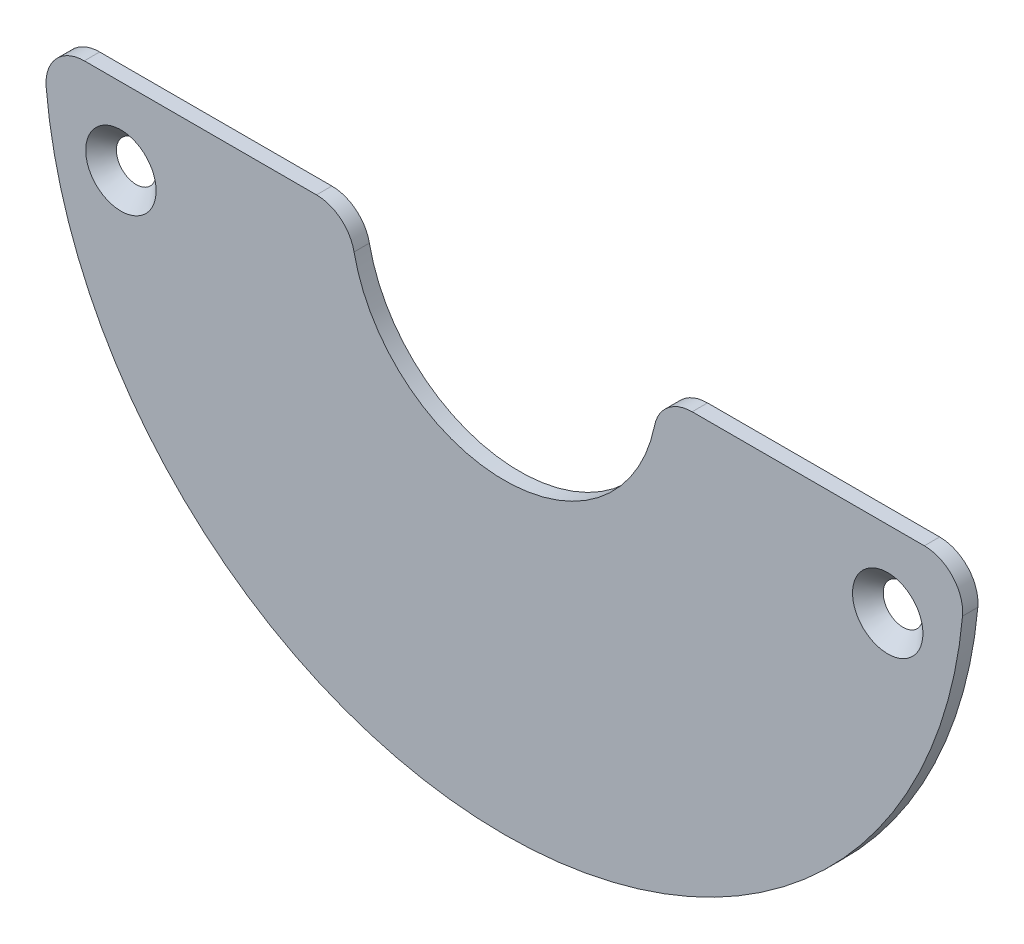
ISO-10303-21;
HEADER;
FILE_DESCRIPTION(('STEP AP214'),'2;1');
FILE_NAME('part.step','',(''),(''),'','','');
FILE_SCHEMA(('AUTOMOTIVE_DESIGN { 1 0 10303 214 1 1 1 1 }'));
ENDSEC;
DATA;
#1=APPLICATION_CONTEXT('core data for automotive mechanical design processes');
#2=APPLICATION_PROTOCOL_DEFINITION('international standard','automotive_design',2000,#1);
#3=PRODUCT_CONTEXT('',#1,'mechanical');
#4=PRODUCT('Part','Part','',(#3));
#5=PRODUCT_RELATED_PRODUCT_CATEGORY('part','',(#4));
#6=PRODUCT_DEFINITION_FORMATION('','',#4);
#7=PRODUCT_DEFINITION_CONTEXT('part definition',#1,'design');
#8=PRODUCT_DEFINITION('design','',#6,#7);
#9=PRODUCT_DEFINITION_SHAPE('','',#8);
#10=(LENGTH_UNIT() NAMED_UNIT(*) SI_UNIT(.MILLI.,.METRE.));
#11=(NAMED_UNIT(*) PLANE_ANGLE_UNIT() SI_UNIT($,.RADIAN.));
#12=(NAMED_UNIT(*) SI_UNIT($,.STERADIAN.) SOLID_ANGLE_UNIT());
#13=UNCERTAINTY_MEASURE_WITH_UNIT(LENGTH_MEASURE(1.E-05),#10,'distance_accuracy_value','');
#14=(GEOMETRIC_REPRESENTATION_CONTEXT(3) GLOBAL_UNCERTAINTY_ASSIGNED_CONTEXT((#13)) GLOBAL_UNIT_ASSIGNED_CONTEXT((#10,
#11,#12)) REPRESENTATION_CONTEXT('',''));
#15=CARTESIAN_POINT('',(0.,0.,0.));
#16=DIRECTION('',(0.,0.,1.));
#17=DIRECTION('',(1.,0.,0.));
#18=AXIS2_PLACEMENT_3D('',#15,#16,#17);
#19=CARTESIAN_POINT('',(24.4948974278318,-5.,0.));
#20=DIRECTION('',(0.,0.,1.));
#21=DIRECTION('',(1.,0.,0.));
#22=AXIS2_PLACEMENT_3D('',#19,#20,#21);
#23=PLANE('',#22);
#24=CARTESIAN_POINT('',(-50.,-10.,0.));
#25=DIRECTION('',(0.,0.,1.));
#26=DIRECTION('',(1.,0.,0.));
#27=AXIS2_PLACEMENT_3D('',#24,#25,#26);
#28=CIRCLE('',#27,2.59);
#29=CARTESIAN_POINT('',(-47.41,-10.,0.));
#30=VERTEX_POINT('',#29);
#31=EDGE_CURVE('E35',#30,#30,#28,.T.);
#32=ORIENTED_EDGE('',*,*,#31,.T.);
#33=EDGE_LOOP('',(#32));
#34=FACE_BOUND('',#33,.T.);
#35=CARTESIAN_POINT('',(24.4948974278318,-5.,0.));
#36=DIRECTION('',(0.,0.,1.));
#37=DIRECTION('',(1.,0.,0.));
#38=AXIS2_PLACEMENT_3D('',#35,#36,#37);
#39=CIRCLE('',#38,5.);
#40=CARTESIAN_POINT('',(24.4948974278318,0.,0.));
#41=VERTEX_POINT('',#40);
#42=CARTESIAN_POINT('',(19.5959179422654,-4.00000000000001,0.));
#43=VERTEX_POINT('',#42);
#44=EDGE_CURVE('E130',#41,#43,#39,.T.);
#45=ORIENTED_EDGE('',*,*,#44,.F.);
#46=DIRECTION('',(-1.,0.,0.));
#47=VECTOR('',#46,1.);
#48=CARTESIAN_POINT('',(24.4948974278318,0.,0.));
#49=LINE('',#48,#47);
#50=CARTESIAN_POINT('',(54.7722557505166,0.,0.));
#51=VERTEX_POINT('',#50);
#52=EDGE_CURVE('E85',#51,#41,#49,.T.);
#53=ORIENTED_EDGE('',*,*,#52,.F.);
#54=CARTESIAN_POINT('',(54.7722557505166,-5.,0.));
#55=DIRECTION('',(0.,0.,1.));
#56=DIRECTION('',(1.,0.,0.));
#57=AXIS2_PLACEMENT_3D('',#54,#55,#56);
#58=CIRCLE('',#57,5.);
#59=CARTESIAN_POINT('',(59.7515517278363,-5.45454545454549,0.));
#60=VERTEX_POINT('',#59);
#61=EDGE_CURVE('E79',#60,#51,#58,.T.);
#62=ORIENTED_EDGE('',*,*,#61,.F.);
#63=CARTESIAN_POINT('',(0.,0.,0.));
#64=DIRECTION('',(0.,0.,1.));
#65=DIRECTION('',(1.,0.,0.));
#66=AXIS2_PLACEMENT_3D('',#63,#64,#65);
#67=CIRCLE('',#66,60.);
#68=CARTESIAN_POINT('',(-59.7515517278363,-5.45454545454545,0.));
#69=VERTEX_POINT('',#68);
#70=EDGE_CURVE('E120',#69,#60,#67,.T.);
#71=ORIENTED_EDGE('',*,*,#70,.F.);
#72=CARTESIAN_POINT('',(-54.7722557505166,-5.,0.));
#73=DIRECTION('',(0.,0.,1.));
#74=DIRECTION('',(1.,0.,0.));
#75=AXIS2_PLACEMENT_3D('',#72,#73,#74);
#76=CIRCLE('',#75,5.);
#77=CARTESIAN_POINT('',(-54.7722557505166,0.,0.));
#78=VERTEX_POINT('',#77);
#79=EDGE_CURVE('E140',#78,#69,#76,.T.);
#80=ORIENTED_EDGE('',*,*,#79,.F.);
#81=DIRECTION('',(-1.,0.,0.));
#82=VECTOR('',#81,1.);
#83=CARTESIAN_POINT('',(-54.7722557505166,0.,0.));
#84=LINE('',#83,#82);
#85=CARTESIAN_POINT('',(-24.4948974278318,0.,0.));
#86=VERTEX_POINT('',#85);
#87=EDGE_CURVE('E138',#86,#78,#84,.T.);
#88=ORIENTED_EDGE('',*,*,#87,.F.);
#89=CARTESIAN_POINT('',(-24.4948974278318,-5.,0.));
#90=DIRECTION('',(0.,0.,1.));
#91=DIRECTION('',(1.,0.,0.));
#92=AXIS2_PLACEMENT_3D('',#89,#90,#91);
#93=CIRCLE('',#92,5.);
#94=CARTESIAN_POINT('',(-19.5959179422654,-4.,0.));
#95=VERTEX_POINT('',#94);
#96=EDGE_CURVE('E136',#95,#86,#93,.T.);
#97=ORIENTED_EDGE('',*,*,#96,.F.);
#98=CARTESIAN_POINT('',(0.,0.,0.));
#99=DIRECTION('',(0.,0.,-1.));
#100=DIRECTION('',(1.,0.,0.));
#101=AXIS2_PLACEMENT_3D('',#98,#99,#100);
#102=CIRCLE('',#101,20.);
#103=EDGE_CURVE('E133',#43,#95,#102,.T.);
#104=ORIENTED_EDGE('',*,*,#103,.F.);
#105=EDGE_LOOP('',(#45,#53,#62,#71,#80,#88,#97,#104));
#106=FACE_BOUND('',#105,.T.);
#107=CARTESIAN_POINT('',(50.,-10.,0.));
#108=DIRECTION('',(0.,0.,1.));
#109=DIRECTION('',(1.,0.,0.));
#110=AXIS2_PLACEMENT_3D('',#107,#108,#109);
#111=CIRCLE('',#110,2.59);
#112=CARTESIAN_POINT('',(52.59,-10.,0.));
#113=VERTEX_POINT('',#112);
#114=EDGE_CURVE('E134',#113,#113,#111,.T.);
#115=ORIENTED_EDGE('',*,*,#114,.T.);
#116=EDGE_LOOP('',(#115));
#117=FACE_BOUND('',#116,.T.);
#118=ADVANCED_FACE('F31',(#34,#106,#117),#23,.F.);
#119=CARTESIAN_POINT('',(24.4948974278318,-5.,2.));
#120=DIRECTION('',(0.,0.,-1.));
#121=DIRECTION('',(-1.,0.,0.));
#122=AXIS2_PLACEMENT_3D('',#119,#120,#121);
#123=CYLINDRICAL_SURFACE('',#122,5.);
#124=ORIENTED_EDGE('',*,*,#44,.T.);
#125=DIRECTION('',(0.,0.,-1.));
#126=VECTOR('',#125,1.);
#127=CARTESIAN_POINT('',(19.5959179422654,-4.00000000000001,2.));
#128=LINE('',#127,#126);
#129=CARTESIAN_POINT('',(19.5959179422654,-4.00000000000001,2.));
#130=VERTEX_POINT('',#129);
#131=EDGE_CURVE('E11',#130,#43,#128,.T.);
#132=ORIENTED_EDGE('',*,*,#131,.F.);
#133=CARTESIAN_POINT('',(24.4948974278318,-5.,2.));
#134=DIRECTION('',(0.,0.,1.));
#135=DIRECTION('',(1.,0.,0.));
#136=AXIS2_PLACEMENT_3D('',#133,#134,#135);
#137=CIRCLE('',#136,5.);
#138=CARTESIAN_POINT('',(24.4948974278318,0.,2.));
#139=VERTEX_POINT('',#138);
#140=EDGE_CURVE('E145',#139,#130,#137,.T.);
#141=ORIENTED_EDGE('',*,*,#140,.F.);
#142=DIRECTION('',(0.,0.,-1.));
#143=VECTOR('',#142,1.);
#144=CARTESIAN_POINT('',(24.4948974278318,0.,2.));
#145=LINE('',#144,#143);
#146=EDGE_CURVE('E126',#139,#41,#145,.T.);
#147=ORIENTED_EDGE('',*,*,#146,.T.);
#148=EDGE_LOOP('',(#124,#132,#141,#147));
#149=FACE_BOUND('',#148,.T.);
#150=ADVANCED_FACE('F33',(#149),#123,.T.);
#151=CARTESIAN_POINT('',(0.,0.,2.));
#152=DIRECTION('',(0.,0.,-1.));
#153=DIRECTION('',(-1.,0.,0.));
#154=AXIS2_PLACEMENT_3D('',#151,#152,#153);
#155=CYLINDRICAL_SURFACE('',#154,20.);
#156=ORIENTED_EDGE('',*,*,#103,.T.);
#157=DIRECTION('',(0.,0.,-1.));
#158=VECTOR('',#157,1.);
#159=CARTESIAN_POINT('',(-19.5959179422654,-4.,2.));
#160=LINE('',#159,#158);
#161=CARTESIAN_POINT('',(-19.5959179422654,-4.,2.));
#162=VERTEX_POINT('',#161);
#163=EDGE_CURVE('E41',#162,#95,#160,.T.);
#164=ORIENTED_EDGE('',*,*,#163,.F.);
#165=CARTESIAN_POINT('',(0.,0.,2.));
#166=DIRECTION('',(0.,0.,-1.));
#167=DIRECTION('',(1.,0.,0.));
#168=AXIS2_PLACEMENT_3D('',#165,#166,#167);
#169=CIRCLE('',#168,20.);
#170=EDGE_CURVE('E93',#130,#162,#169,.T.);
#171=ORIENTED_EDGE('',*,*,#170,.F.);
#172=ORIENTED_EDGE('',*,*,#131,.T.);
#173=EDGE_LOOP('',(#156,#164,#171,#172));
#174=FACE_BOUND('',#173,.T.);
#175=ADVANCED_FACE('F206',(#174),#155,.F.);
#176=CARTESIAN_POINT('',(-24.4948974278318,-5.,2.));
#177=DIRECTION('',(0.,0.,-1.));
#178=DIRECTION('',(-1.,0.,0.));
#179=AXIS2_PLACEMENT_3D('',#176,#177,#178);
#180=CYLINDRICAL_SURFACE('',#179,5.);
#181=ORIENTED_EDGE('',*,*,#96,.T.);
#182=DIRECTION('',(0.,0.,-1.));
#183=VECTOR('',#182,1.);
#184=CARTESIAN_POINT('',(-24.4948974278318,0.,2.));
#185=LINE('',#184,#183);
#186=CARTESIAN_POINT('',(-24.4948974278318,0.,2.));
#187=VERTEX_POINT('',#186);
#188=EDGE_CURVE('E152',#187,#86,#185,.T.);
#189=ORIENTED_EDGE('',*,*,#188,.F.);
#190=CARTESIAN_POINT('',(-24.4948974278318,-5.,2.));
#191=DIRECTION('',(0.,0.,1.));
#192=DIRECTION('',(1.,0.,0.));
#193=AXIS2_PLACEMENT_3D('',#190,#191,#192);
#194=CIRCLE('',#193,5.);
#195=EDGE_CURVE('E170',#162,#187,#194,.T.);
#196=ORIENTED_EDGE('',*,*,#195,.F.);
#197=ORIENTED_EDGE('',*,*,#163,.T.);
#198=EDGE_LOOP('',(#181,#189,#196,#197));
#199=FACE_BOUND('',#198,.T.);
#200=ADVANCED_FACE('F267',(#199),#180,.T.);
#201=CARTESIAN_POINT('',(-54.7722557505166,0.,2.));
#202=DIRECTION('',(0.,-1.,0.));
#203=DIRECTION('',(0.,0.,-1.));
#204=AXIS2_PLACEMENT_3D('',#201,#202,#203);
#205=PLANE('',#204);
#206=ORIENTED_EDGE('',*,*,#87,.T.);
#207=DIRECTION('',(0.,0.,-1.));
#208=VECTOR('',#207,1.);
#209=CARTESIAN_POINT('',(-54.7722557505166,0.,2.));
#210=LINE('',#209,#208);
#211=CARTESIAN_POINT('',(-54.7722557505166,0.,2.));
#212=VERTEX_POINT('',#211);
#213=EDGE_CURVE('E149',#212,#78,#210,.T.);
#214=ORIENTED_EDGE('',*,*,#213,.F.);
#215=DIRECTION('',(-1.,0.,0.));
#216=VECTOR('',#215,1.);
#217=CARTESIAN_POINT('',(-54.7722557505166,0.,2.));
#218=LINE('',#217,#216);
#219=EDGE_CURVE('E172',#187,#212,#218,.T.);
#220=ORIENTED_EDGE('',*,*,#219,.F.);
#221=ORIENTED_EDGE('',*,*,#188,.T.);
#222=EDGE_LOOP('',(#206,#214,#220,#221));
#223=FACE_BOUND('',#222,.T.);
#224=ADVANCED_FACE('F178',(#223),#205,.F.);
#225=CARTESIAN_POINT('',(-54.7722557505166,-5.,2.));
#226=DIRECTION('',(0.,0.,-1.));
#227=DIRECTION('',(-1.,0.,0.));
#228=AXIS2_PLACEMENT_3D('',#225,#226,#227);
#229=CYLINDRICAL_SURFACE('',#228,5.);
#230=ORIENTED_EDGE('',*,*,#79,.T.);
#231=DIRECTION('',(0.,0.,-1.));
#232=VECTOR('',#231,1.);
#233=CARTESIAN_POINT('',(-59.7515517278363,-5.45454545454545,2.));
#234=LINE('',#233,#232);
#235=CARTESIAN_POINT('',(-59.7515517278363,-5.45454545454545,2.));
#236=VERTEX_POINT('',#235);
#237=EDGE_CURVE('E121',#236,#69,#234,.T.);
#238=ORIENTED_EDGE('',*,*,#237,.F.);
#239=CARTESIAN_POINT('',(-54.7722557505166,-5.,2.));
#240=DIRECTION('',(0.,0.,1.));
#241=DIRECTION('',(1.,0.,0.));
#242=AXIS2_PLACEMENT_3D('',#239,#240,#241);
#243=CIRCLE('',#242,5.);
#244=EDGE_CURVE('E112',#212,#236,#243,.T.);
#245=ORIENTED_EDGE('',*,*,#244,.F.);
#246=ORIENTED_EDGE('',*,*,#213,.T.);
#247=EDGE_LOOP('',(#230,#238,#245,#246));
#248=FACE_BOUND('',#247,.T.);
#249=ADVANCED_FACE('F182',(#248),#229,.T.);
#250=CARTESIAN_POINT('',(0.,0.,2.));
#251=DIRECTION('',(0.,0.,-1.));
#252=DIRECTION('',(-1.,0.,0.));
#253=AXIS2_PLACEMENT_3D('',#250,#251,#252);
#254=CYLINDRICAL_SURFACE('',#253,60.);
#255=ORIENTED_EDGE('',*,*,#70,.T.);
#256=DIRECTION('',(0.,0.,-1.));
#257=VECTOR('',#256,1.);
#258=CARTESIAN_POINT('',(59.7515517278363,-5.45454545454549,2.));
#259=LINE('',#258,#257);
#260=CARTESIAN_POINT('',(59.7515517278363,-5.45454545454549,2.));
#261=VERTEX_POINT('',#260);
#262=EDGE_CURVE('E117',#261,#60,#259,.T.);
#263=ORIENTED_EDGE('',*,*,#262,.F.);
#264=CARTESIAN_POINT('',(0.,0.,2.));
#265=DIRECTION('',(0.,0.,1.));
#266=DIRECTION('',(1.,0.,0.));
#267=AXIS2_PLACEMENT_3D('',#264,#265,#266);
#268=CIRCLE('',#267,60.);
#269=EDGE_CURVE('E106',#236,#261,#268,.T.);
#270=ORIENTED_EDGE('',*,*,#269,.F.);
#271=ORIENTED_EDGE('',*,*,#237,.T.);
#272=EDGE_LOOP('',(#255,#263,#270,#271));
#273=FACE_BOUND('',#272,.T.);
#274=ADVANCED_FACE('F118',(#273),#254,.T.);
#275=CARTESIAN_POINT('',(54.7722557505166,-5.,2.));
#276=DIRECTION('',(0.,0.,-1.));
#277=DIRECTION('',(-1.,0.,0.));
#278=AXIS2_PLACEMENT_3D('',#275,#276,#277);
#279=CYLINDRICAL_SURFACE('',#278,5.);
#280=ORIENTED_EDGE('',*,*,#61,.T.);
#281=DIRECTION('',(0.,0.,-1.));
#282=VECTOR('',#281,1.);
#283=CARTESIAN_POINT('',(54.7722557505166,0.,2.));
#284=LINE('',#283,#282);
#285=CARTESIAN_POINT('',(54.7722557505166,0.,2.));
#286=VERTEX_POINT('',#285);
#287=EDGE_CURVE('E122',#286,#51,#284,.T.);
#288=ORIENTED_EDGE('',*,*,#287,.F.);
#289=CARTESIAN_POINT('',(54.7722557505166,-5.,2.));
#290=DIRECTION('',(0.,0.,1.));
#291=DIRECTION('',(1.,0.,0.));
#292=AXIS2_PLACEMENT_3D('',#289,#290,#291);
#293=CIRCLE('',#292,5.);
#294=EDGE_CURVE('E110',#261,#286,#293,.T.);
#295=ORIENTED_EDGE('',*,*,#294,.F.);
#296=ORIENTED_EDGE('',*,*,#262,.T.);
#297=EDGE_LOOP('',(#280,#288,#295,#296));
#298=FACE_BOUND('',#297,.T.);
#299=ADVANCED_FACE('F124',(#298),#279,.T.);
#300=CARTESIAN_POINT('',(24.4948974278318,0.,2.));
#301=DIRECTION('',(0.,-1.,0.));
#302=DIRECTION('',(0.,0.,-1.));
#303=AXIS2_PLACEMENT_3D('',#300,#301,#302);
#304=PLANE('',#303);
#305=ORIENTED_EDGE('',*,*,#52,.T.);
#306=ORIENTED_EDGE('',*,*,#146,.F.);
#307=DIRECTION('',(-1.,0.,0.));
#308=VECTOR('',#307,1.);
#309=CARTESIAN_POINT('',(24.4948974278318,0.,2.));
#310=LINE('',#309,#308);
#311=EDGE_CURVE('E50',#286,#139,#310,.T.);
#312=ORIENTED_EDGE('',*,*,#311,.F.);
#313=ORIENTED_EDGE('',*,*,#287,.T.);
#314=EDGE_LOOP('',(#305,#306,#312,#313));
#315=FACE_BOUND('',#314,.T.);
#316=ADVANCED_FACE('F189',(#315),#304,.F.);
#317=CARTESIAN_POINT('',(24.4948974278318,-5.,2.));
#318=DIRECTION('',(0.,0.,1.));
#319=DIRECTION('',(1.,0.,0.));
#320=AXIS2_PLACEMENT_3D('',#317,#318,#319);
#321=PLANE('',#320);
#322=CARTESIAN_POINT('',(-50.,-10.,2.));
#323=DIRECTION('',(0.,0.,1.));
#324=DIRECTION('',(1.,0.,0.));
#325=AXIS2_PLACEMENT_3D('',#322,#323,#324);
#326=CIRCLE('',#325,4.59);
#327=CARTESIAN_POINT('',(-45.41,-10.,2.));
#328=VERTEX_POINT('',#327);
#329=EDGE_CURVE('E165',#328,#328,#326,.T.);
#330=ORIENTED_EDGE('',*,*,#329,.F.);
#331=EDGE_LOOP('',(#330));
#332=FACE_BOUND('',#331,.T.);
#333=CARTESIAN_POINT('',(50.,-10.,2.));
#334=DIRECTION('',(0.,0.,1.));
#335=DIRECTION('',(1.,0.,0.));
#336=AXIS2_PLACEMENT_3D('',#333,#334,#335);
#337=CIRCLE('',#336,4.59);
#338=CARTESIAN_POINT('',(54.59,-10.,2.));
#339=VERTEX_POINT('',#338);
#340=EDGE_CURVE('E157',#339,#339,#337,.T.);
#341=ORIENTED_EDGE('',*,*,#340,.F.);
#342=EDGE_LOOP('',(#341));
#343=FACE_BOUND('',#342,.T.);
#344=ORIENTED_EDGE('',*,*,#140,.T.);
#345=ORIENTED_EDGE('',*,*,#170,.T.);
#346=ORIENTED_EDGE('',*,*,#195,.T.);
#347=ORIENTED_EDGE('',*,*,#219,.T.);
#348=ORIENTED_EDGE('',*,*,#244,.T.);
#349=ORIENTED_EDGE('',*,*,#269,.T.);
#350=ORIENTED_EDGE('',*,*,#294,.T.);
#351=ORIENTED_EDGE('',*,*,#311,.T.);
#352=EDGE_LOOP('',(#344,#345,#346,#347,#348,#349,#350,#351));
#353=FACE_BOUND('',#352,.T.);
#354=ADVANCED_FACE('F108',(#332,#343,#353),#321,.T.);
#355=CARTESIAN_POINT('',(50.,-10.,2.));
#356=DIRECTION('',(0.,0.,1.));
#357=DIRECTION('',(1.,0.,0.));
#358=AXIS2_PLACEMENT_3D('',#355,#356,#357);
#359=CONICAL_SURFACE('',#358,4.59,0.785398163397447);
#360=ORIENTED_EDGE('',*,*,#340,.T.);
#361=EDGE_LOOP('',(#360));
#362=FACE_BOUND('',#361,.T.);
#363=ORIENTED_EDGE('',*,*,#114,.F.);
#364=EDGE_LOOP('',(#363));
#365=FACE_BOUND('',#364,.T.);
#366=ADVANCED_FACE('F196',(#362,#365),#359,.F.);
#367=CARTESIAN_POINT('',(-50.,-10.,2.));
#368=DIRECTION('',(0.,0.,1.));
#369=DIRECTION('',(1.,0.,0.));
#370=AXIS2_PLACEMENT_3D('',#367,#368,#369);
#371=CONICAL_SURFACE('',#370,4.59,0.785398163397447);
#372=ORIENTED_EDGE('',*,*,#329,.T.);
#373=EDGE_LOOP('',(#372));
#374=FACE_BOUND('',#373,.T.);
#375=ORIENTED_EDGE('',*,*,#31,.F.);
#376=EDGE_LOOP('',(#375));
#377=FACE_BOUND('',#376,.T.);
#378=ADVANCED_FACE('F210',(#374,#377),#371,.F.);
#379=CLOSED_SHELL('',(#118,#150,#175,#200,#224,#249,#274,#299,#316,#354,#366,#378));
#380=MANIFOLD_SOLID_BREP('B2',#379);
#381=ADVANCED_BREP_SHAPE_REPRESENTATION('',(#18,#380),#14);
#382=SHAPE_DEFINITION_REPRESENTATION(#9,#381);
ENDSEC;
END-ISO-10303-21;
